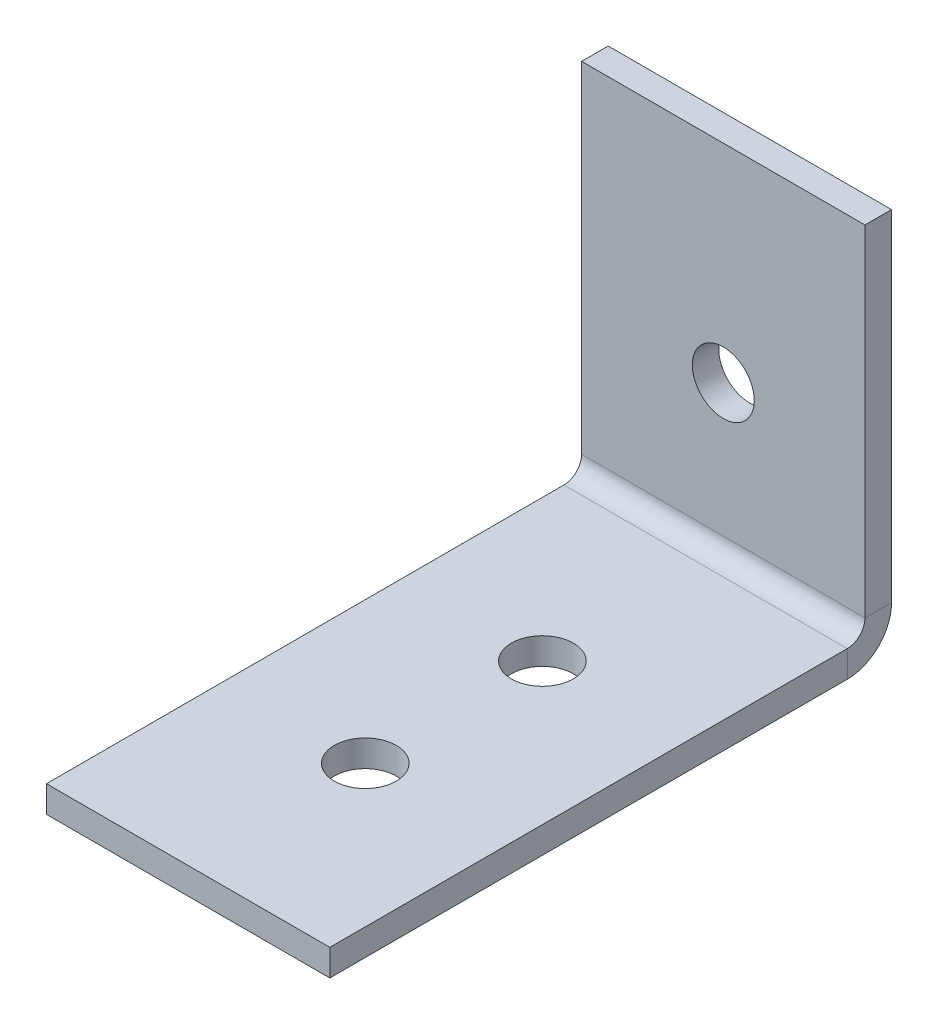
ISO-10303-21;
HEADER;
FILE_DESCRIPTION(('STEP AP214'),'2;1');
FILE_NAME('part.step','',(''),(''),'','','');
FILE_SCHEMA(('AUTOMOTIVE_DESIGN { 1 0 10303 214 1 1 1 1 }'));
ENDSEC;
DATA;
#1=APPLICATION_CONTEXT('core data for automotive mechanical design processes');
#2=APPLICATION_PROTOCOL_DEFINITION('international standard','automotive_design',2000,#1);
#3=PRODUCT_CONTEXT('',#1,'mechanical');
#4=PRODUCT('Part','Part','',(#3));
#5=PRODUCT_RELATED_PRODUCT_CATEGORY('part','',(#4));
#6=PRODUCT_DEFINITION_FORMATION('','',#4);
#7=PRODUCT_DEFINITION_CONTEXT('part definition',#1,'design');
#8=PRODUCT_DEFINITION('design','',#6,#7);
#9=PRODUCT_DEFINITION_SHAPE('','',#8);
#10=(LENGTH_UNIT() NAMED_UNIT(*) SI_UNIT(.MILLI.,.METRE.));
#11=(NAMED_UNIT(*) PLANE_ANGLE_UNIT() SI_UNIT($,.RADIAN.));
#12=(NAMED_UNIT(*) SI_UNIT($,.STERADIAN.) SOLID_ANGLE_UNIT());
#13=UNCERTAINTY_MEASURE_WITH_UNIT(LENGTH_MEASURE(1.E-05),#10,'distance_accuracy_value','');
#14=(GEOMETRIC_REPRESENTATION_CONTEXT(3) GLOBAL_UNCERTAINTY_ASSIGNED_CONTEXT((#13)) GLOBAL_UNIT_ASSIGNED_CONTEXT((#10,
#11,#12)) REPRESENTATION_CONTEXT('',''));
#15=CARTESIAN_POINT('',(0.,0.,0.));
#16=DIRECTION('',(0.,0.,1.));
#17=DIRECTION('',(1.,0.,0.));
#18=AXIS2_PLACEMENT_3D('',#15,#16,#17);
#19=CARTESIAN_POINT('',(16.,-28.2854099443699,-30.2145900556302));
#20=DIRECTION('',(-1.,0.,0.));
#21=DIRECTION('',(0.,-1.,0.));
#22=AXIS2_PLACEMENT_3D('',#19,#20,#21);
#23=PLANE('',#22);
#24=DIRECTION('',(0.,1.,0.));
#25=VECTOR('',#24,1.);
#26=CARTESIAN_POINT('',(16.,-28.2854099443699,-30.2145900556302));
#27=LINE('',#26,#25);
#28=CARTESIAN_POINT('',(16.,2.50000000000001,-30.2145900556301));
#29=VERTEX_POINT('',#28);
#30=CARTESIAN_POINT('',(16.,21.7145900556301,-30.21459005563));
#31=VERTEX_POINT('',#30);
#32=EDGE_CURVE('E99',#29,#31,#27,.T.);
#33=ORIENTED_EDGE('',*,*,#32,.F.);
#34=DIRECTION('',(0.,0.,-1.));
#35=VECTOR('',#34,1.);
#36=CARTESIAN_POINT('',(16.,2.5,-30.2145900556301));
#37=LINE('',#36,#35);
#38=CARTESIAN_POINT('',(16.,2.50000000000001,-31.7145900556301));
#39=VERTEX_POINT('',#38);
#40=EDGE_CURVE('E12',#29,#39,#37,.T.);
#41=ORIENTED_EDGE('',*,*,#40,.T.);
#42=DIRECTION('',(0.,1.,0.));
#43=VECTOR('',#42,1.);
#44=CARTESIAN_POINT('',(16.,-28.2854099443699,-31.7145900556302));
#45=LINE('',#44,#43);
#46=CARTESIAN_POINT('',(16.,21.7145900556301,-31.71459005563));
#47=VERTEX_POINT('',#46);
#48=EDGE_CURVE('E83',#39,#47,#45,.T.);
#49=ORIENTED_EDGE('',*,*,#48,.T.);
#50=DIRECTION('',(0.,0.,-1.));
#51=VECTOR('',#50,1.);
#52=CARTESIAN_POINT('',(16.,21.7145900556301,-30.21459005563));
#53=LINE('',#52,#51);
#54=EDGE_CURVE('E79',#31,#47,#53,.T.);
#55=ORIENTED_EDGE('',*,*,#54,.F.);
#56=EDGE_LOOP('',(#33,#41,#49,#55));
#57=FACE_BOUND('',#56,.T.);
#58=ADVANCED_FACE('F36',(#57),#23,.F.);
#59=CARTESIAN_POINT('',(0.,-28.2854099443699,-30.2145900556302));
#60=DIRECTION('',(1.,0.,0.));
#61=DIRECTION('',(0.,1.,0.));
#62=AXIS2_PLACEMENT_3D('',#59,#60,#61);
#63=PLANE('',#62);
#64=DIRECTION('',(0.,-1.,0.));
#65=VECTOR('',#64,1.);
#66=CARTESIAN_POINT('',(0.,-28.2854099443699,-31.7145900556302));
#67=LINE('',#66,#65);
#68=CARTESIAN_POINT('',(0.,21.7145900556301,-31.71459005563));
#69=VERTEX_POINT('',#68);
#70=CARTESIAN_POINT('',(0.,2.50000000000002,-31.7145900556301));
#71=VERTEX_POINT('',#70);
#72=EDGE_CURVE('E90',#69,#71,#67,.T.);
#73=ORIENTED_EDGE('',*,*,#72,.T.);
#74=DIRECTION('',(0.,0.,1.));
#75=VECTOR('',#74,1.);
#76=CARTESIAN_POINT('',(0.,2.5,-30.2145900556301));
#77=LINE('',#76,#75);
#78=CARTESIAN_POINT('',(0.,2.50000000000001,-30.2145900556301));
#79=VERTEX_POINT('',#78);
#80=EDGE_CURVE('E112',#71,#79,#77,.T.);
#81=ORIENTED_EDGE('',*,*,#80,.T.);
#82=DIRECTION('',(0.,-1.,0.));
#83=VECTOR('',#82,1.);
#84=CARTESIAN_POINT('',(0.,-28.2854099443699,-30.2145900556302));
#85=LINE('',#84,#83);
#86=CARTESIAN_POINT('',(0.,21.7145900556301,-30.21459005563));
#87=VERTEX_POINT('',#86);
#88=EDGE_CURVE('E39',#87,#79,#85,.T.);
#89=ORIENTED_EDGE('',*,*,#88,.F.);
#90=DIRECTION('',(0.,0.,-1.));
#91=VECTOR('',#90,1.);
#92=CARTESIAN_POINT('',(0.,21.7145900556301,-30.21459005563));
#93=LINE('',#92,#91);
#94=EDGE_CURVE('E76',#87,#69,#93,.T.);
#95=ORIENTED_EDGE('',*,*,#94,.T.);
#96=EDGE_LOOP('',(#73,#81,#89,#95));
#97=FACE_BOUND('',#96,.T.);
#98=ADVANCED_FACE('F87',(#97),#63,.F.);
#99=CARTESIAN_POINT('',(0.,21.7145900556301,-30.21459005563));
#100=DIRECTION('',(0.,0.,-1.));
#101=DIRECTION('',(0.,1.,0.));
#102=AXIS2_PLACEMENT_3D('',#99,#100,#101);
#103=PLANE('',#102);
#104=CARTESIAN_POINT('',(8.,10.,-30.2145900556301));
#105=DIRECTION('',(0.,0.,-1.));
#106=DIRECTION('',(0.,1.,0.));
#107=AXIS2_PLACEMENT_3D('',#104,#105,#106);
#108=CIRCLE('',#107,1.75);
#109=CARTESIAN_POINT('',(8.,11.75,-30.2145900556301));
#110=VERTEX_POINT('',#109);
#111=EDGE_CURVE('E168',#110,#110,#108,.T.);
#112=ORIENTED_EDGE('',*,*,#111,.T.);
#113=EDGE_LOOP('',(#112));
#114=FACE_BOUND('',#113,.T.);
#115=ORIENTED_EDGE('',*,*,#88,.T.);
#116=DIRECTION('',(1.,0.,0.));
#117=VECTOR('',#116,1.);
#118=CARTESIAN_POINT('',(0.,2.5,-30.2145900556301));
#119=LINE('',#118,#117);
#120=EDGE_CURVE('E107',#79,#29,#119,.T.);
#121=ORIENTED_EDGE('',*,*,#120,.T.);
#122=ORIENTED_EDGE('',*,*,#32,.T.);
#123=DIRECTION('',(-1.,0.,0.));
#124=VECTOR('',#123,1.);
#125=CARTESIAN_POINT('',(0.,21.7145900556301,-30.21459005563));
#126=LINE('',#125,#124);
#127=EDGE_CURVE('E60',#31,#87,#126,.T.);
#128=ORIENTED_EDGE('',*,*,#127,.T.);
#129=EDGE_LOOP('',(#115,#121,#122,#128));
#130=FACE_BOUND('',#129,.T.);
#131=ADVANCED_FACE('F104',(#114,#130),#103,.F.);
#132=CARTESIAN_POINT('',(0.,21.7145900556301,-31.71459005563));
#133=DIRECTION('',(0.,0.,-1.));
#134=DIRECTION('',(0.,1.,0.));
#135=AXIS2_PLACEMENT_3D('',#132,#133,#134);
#136=PLANE('',#135);
#137=CARTESIAN_POINT('',(8.,10.,-31.7145900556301));
#138=DIRECTION('',(0.,0.,-1.));
#139=DIRECTION('',(0.,1.,0.));
#140=AXIS2_PLACEMENT_3D('',#137,#138,#139);
#141=CIRCLE('',#140,1.75);
#142=CARTESIAN_POINT('',(8.,11.75,-31.7145900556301));
#143=VERTEX_POINT('',#142);
#144=EDGE_CURVE('E175',#143,#143,#141,.T.);
#145=ORIENTED_EDGE('',*,*,#144,.F.);
#146=EDGE_LOOP('',(#145));
#147=FACE_BOUND('',#146,.T.);
#148=DIRECTION('',(1.,0.,0.));
#149=VECTOR('',#148,1.);
#150=CARTESIAN_POINT('',(0.,2.50000000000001,-31.7145900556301));
#151=LINE('',#150,#149);
#152=EDGE_CURVE('E44',#71,#39,#151,.T.);
#153=ORIENTED_EDGE('',*,*,#152,.F.);
#154=ORIENTED_EDGE('',*,*,#72,.F.);
#155=DIRECTION('',(-1.,0.,0.));
#156=VECTOR('',#155,1.);
#157=CARTESIAN_POINT('',(0.,21.7145900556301,-31.71459005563));
#158=LINE('',#157,#156);
#159=EDGE_CURVE('E73',#47,#69,#158,.T.);
#160=ORIENTED_EDGE('',*,*,#159,.F.);
#161=ORIENTED_EDGE('',*,*,#48,.F.);
#162=EDGE_LOOP('',(#153,#154,#160,#161));
#163=FACE_BOUND('',#162,.T.);
#164=ADVANCED_FACE('F92',(#147,#163),#136,.T.);
#165=CARTESIAN_POINT('',(0.,21.7145900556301,-30.21459005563));
#166=DIRECTION('',(0.,-1.,0.));
#167=DIRECTION('',(1.,0.,0.));
#168=AXIS2_PLACEMENT_3D('',#165,#166,#167);
#169=PLANE('',#168);
#170=ORIENTED_EDGE('',*,*,#159,.T.);
#171=ORIENTED_EDGE('',*,*,#94,.F.);
#172=ORIENTED_EDGE('',*,*,#127,.F.);
#173=ORIENTED_EDGE('',*,*,#54,.T.);
#174=EDGE_LOOP('',(#170,#171,#172,#173));
#175=FACE_BOUND('',#174,.T.);
#176=ADVANCED_FACE('F75',(#175),#169,.F.);
#177=CARTESIAN_POINT('',(8.,1.5,-20.));
#178=DIRECTION('',(0.,-1.,0.));
#179=DIRECTION('',(0.,0.,-1.));
#180=AXIS2_PLACEMENT_3D('',#177,#178,#179);
#181=CYLINDRICAL_SURFACE('',#180,1.75);
#182=CARTESIAN_POINT('',(8.,1.5,-20.));
#183=DIRECTION('',(0.,1.,0.));
#184=DIRECTION('',(0.,0.,1.));
#185=AXIS2_PLACEMENT_3D('',#182,#183,#184);
#186=CIRCLE('',#185,1.75);
#187=CARTESIAN_POINT('',(8.,1.5,-18.25));
#188=VERTEX_POINT('',#187);
#189=EDGE_CURVE('E130',#188,#188,#186,.T.);
#190=ORIENTED_EDGE('',*,*,#189,.T.);
#191=EDGE_LOOP('',(#190));
#192=FACE_BOUND('',#191,.T.);
#193=CARTESIAN_POINT('',(8.,0.,-20.));
#194=DIRECTION('',(0.,1.,0.));
#195=DIRECTION('',(0.,0.,1.));
#196=AXIS2_PLACEMENT_3D('',#193,#194,#195);
#197=CIRCLE('',#196,1.75);
#198=CARTESIAN_POINT('',(8.,0.,-18.25));
#199=VERTEX_POINT('',#198);
#200=EDGE_CURVE('E157',#199,#199,#197,.T.);
#201=ORIENTED_EDGE('',*,*,#200,.F.);
#202=EDGE_LOOP('',(#201));
#203=FACE_BOUND('',#202,.T.);
#204=ADVANCED_FACE('F194',(#192,#203),#181,.F.);
#205=CARTESIAN_POINT('',(8.,1.5,-10.));
#206=DIRECTION('',(0.,-1.,0.));
#207=DIRECTION('',(0.,0.,-1.));
#208=AXIS2_PLACEMENT_3D('',#205,#206,#207);
#209=CYLINDRICAL_SURFACE('',#208,1.75);
#210=CARTESIAN_POINT('',(8.,1.5,-10.));
#211=DIRECTION('',(0.,1.,0.));
#212=DIRECTION('',(0.,0.,1.));
#213=AXIS2_PLACEMENT_3D('',#210,#211,#212);
#214=CIRCLE('',#213,1.75);
#215=CARTESIAN_POINT('',(8.,1.5,-8.25));
#216=VERTEX_POINT('',#215);
#217=EDGE_CURVE('E133',#216,#216,#214,.T.);
#218=ORIENTED_EDGE('',*,*,#217,.T.);
#219=EDGE_LOOP('',(#218));
#220=FACE_BOUND('',#219,.T.);
#221=CARTESIAN_POINT('',(8.,0.,-10.));
#222=DIRECTION('',(0.,1.,0.));
#223=DIRECTION('',(0.,0.,1.));
#224=AXIS2_PLACEMENT_3D('',#221,#222,#223);
#225=CIRCLE('',#224,1.75);
#226=CARTESIAN_POINT('',(8.,0.,-8.25));
#227=VERTEX_POINT('',#226);
#228=EDGE_CURVE('E154',#227,#227,#225,.T.);
#229=ORIENTED_EDGE('',*,*,#228,.F.);
#230=EDGE_LOOP('',(#229));
#231=FACE_BOUND('',#230,.T.);
#232=ADVANCED_FACE('F251',(#220,#231),#209,.F.);
#233=CARTESIAN_POINT('',(0.,1.5,0.));
#234=DIRECTION('',(0.,0.,-1.));
#235=DIRECTION('',(-1.,0.,0.));
#236=AXIS2_PLACEMENT_3D('',#233,#234,#235);
#237=PLANE('',#236);
#238=DIRECTION('',(1.,0.,0.));
#239=VECTOR('',#238,1.);
#240=CARTESIAN_POINT('',(0.,0.,0.));
#241=LINE('',#240,#239);
#242=CARTESIAN_POINT('',(0.,0.,0.));
#243=VERTEX_POINT('',#242);
#244=CARTESIAN_POINT('',(16.,0.,0.));
#245=VERTEX_POINT('',#244);
#246=EDGE_CURVE('E136',#243,#245,#241,.T.);
#247=ORIENTED_EDGE('',*,*,#246,.T.);
#248=DIRECTION('',(0.,-1.,0.));
#249=VECTOR('',#248,1.);
#250=CARTESIAN_POINT('',(16.,1.5,0.));
#251=LINE('',#250,#249);
#252=CARTESIAN_POINT('',(16.,1.5,0.));
#253=VERTEX_POINT('',#252);
#254=EDGE_CURVE('E97',#253,#245,#251,.T.);
#255=ORIENTED_EDGE('',*,*,#254,.F.);
#256=DIRECTION('',(1.,0.,0.));
#257=VECTOR('',#256,1.);
#258=CARTESIAN_POINT('',(0.,1.5,0.));
#259=LINE('',#258,#257);
#260=CARTESIAN_POINT('',(0.,1.5,0.));
#261=VERTEX_POINT('',#260);
#262=EDGE_CURVE('E145',#261,#253,#259,.T.);
#263=ORIENTED_EDGE('',*,*,#262,.F.);
#264=DIRECTION('',(0.,-1.,0.));
#265=VECTOR('',#264,1.);
#266=CARTESIAN_POINT('',(0.,1.5,0.));
#267=LINE('',#266,#265);
#268=EDGE_CURVE('E139',#261,#243,#267,.T.);
#269=ORIENTED_EDGE('',*,*,#268,.T.);
#270=EDGE_LOOP('',(#247,#255,#263,#269));
#271=FACE_BOUND('',#270,.T.);
#272=ADVANCED_FACE('F255',(#271),#237,.F.);
#273=CARTESIAN_POINT('',(0.,1.5,-50.));
#274=DIRECTION('',(0.,-1.,0.));
#275=DIRECTION('',(0.,0.,-1.));
#276=AXIS2_PLACEMENT_3D('',#273,#274,#275);
#277=PLANE('',#276);
#278=DIRECTION('',(1.,0.,0.));
#279=VECTOR('',#278,1.);
#280=CARTESIAN_POINT('',(0.,1.5,-29.2145900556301));
#281=LINE('',#280,#279);
#282=CARTESIAN_POINT('',(0.,1.5,-29.2145900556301));
#283=VERTEX_POINT('',#282);
#284=CARTESIAN_POINT('',(16.,1.5,-29.2145900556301));
#285=VERTEX_POINT('',#284);
#286=EDGE_CURVE('E120',#283,#285,#281,.T.);
#287=ORIENTED_EDGE('',*,*,#286,.F.);
#288=DIRECTION('',(0.,0.,1.));
#289=VECTOR('',#288,1.);
#290=CARTESIAN_POINT('',(0.,1.5,0.));
#291=LINE('',#290,#289);
#292=EDGE_CURVE('E142',#283,#261,#291,.T.);
#293=ORIENTED_EDGE('',*,*,#292,.T.);
#294=ORIENTED_EDGE('',*,*,#262,.T.);
#295=DIRECTION('',(0.,0.,-1.));
#296=VECTOR('',#295,1.);
#297=CARTESIAN_POINT('',(16.,1.5,0.));
#298=LINE('',#297,#296);
#299=EDGE_CURVE('E148',#253,#285,#298,.T.);
#300=ORIENTED_EDGE('',*,*,#299,.T.);
#301=EDGE_LOOP('',(#287,#293,#294,#300));
#302=FACE_BOUND('',#301,.T.);
#303=ORIENTED_EDGE('',*,*,#217,.F.);
#304=EDGE_LOOP('',(#303));
#305=FACE_BOUND('',#304,.T.);
#306=ORIENTED_EDGE('',*,*,#189,.F.);
#307=EDGE_LOOP('',(#306));
#308=FACE_BOUND('',#307,.T.);
#309=ADVANCED_FACE('F259',(#302,#305,#308),#277,.F.);
#310=CARTESIAN_POINT('',(0.,1.5,0.));
#311=DIRECTION('',(1.,0.,0.));
#312=DIRECTION('',(0.,0.,-1.));
#313=AXIS2_PLACEMENT_3D('',#310,#311,#312);
#314=PLANE('',#313);
#315=DIRECTION('',(0.,1.,0.));
#316=VECTOR('',#315,1.);
#317=CARTESIAN_POINT('',(0.,1.5,-29.2145900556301));
#318=LINE('',#317,#316);
#319=CARTESIAN_POINT('',(0.,0.,-29.2145900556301));
#320=VERTEX_POINT('',#319);
#321=EDGE_CURVE('E127',#320,#283,#318,.T.);
#322=ORIENTED_EDGE('',*,*,#321,.F.);
#323=DIRECTION('',(0.,0.,1.));
#324=VECTOR('',#323,1.);
#325=CARTESIAN_POINT('',(0.,0.,0.));
#326=LINE('',#325,#324);
#327=EDGE_CURVE('E151',#320,#243,#326,.T.);
#328=ORIENTED_EDGE('',*,*,#327,.T.);
#329=ORIENTED_EDGE('',*,*,#268,.F.);
#330=ORIENTED_EDGE('',*,*,#292,.F.);
#331=EDGE_LOOP('',(#322,#328,#329,#330));
#332=FACE_BOUND('',#331,.T.);
#333=ADVANCED_FACE('F263',(#332),#314,.F.);
#334=CARTESIAN_POINT('',(0.,0.,-50.));
#335=DIRECTION('',(0.,-1.,0.));
#336=DIRECTION('',(0.,0.,-1.));
#337=AXIS2_PLACEMENT_3D('',#334,#335,#336);
#338=PLANE('',#337);
#339=ORIENTED_EDGE('',*,*,#228,.T.);
#340=EDGE_LOOP('',(#339));
#341=FACE_BOUND('',#340,.T.);
#342=ORIENTED_EDGE('',*,*,#200,.T.);
#343=EDGE_LOOP('',(#342));
#344=FACE_BOUND('',#343,.T.);
#345=ORIENTED_EDGE('',*,*,#327,.F.);
#346=DIRECTION('',(1.,0.,0.));
#347=VECTOR('',#346,1.);
#348=CARTESIAN_POINT('',(0.,0.,-29.2145900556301));
#349=LINE('',#348,#347);
#350=CARTESIAN_POINT('',(16.,0.,-29.2145900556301));
#351=VERTEX_POINT('',#350);
#352=EDGE_CURVE('E160',#320,#351,#349,.T.);
#353=ORIENTED_EDGE('',*,*,#352,.T.);
#354=DIRECTION('',(0.,0.,-1.));
#355=VECTOR('',#354,1.);
#356=CARTESIAN_POINT('',(16.,0.,0.));
#357=LINE('',#356,#355);
#358=EDGE_CURVE('E93',#245,#351,#357,.T.);
#359=ORIENTED_EDGE('',*,*,#358,.F.);
#360=ORIENTED_EDGE('',*,*,#246,.F.);
#361=EDGE_LOOP('',(#345,#353,#359,#360));
#362=FACE_BOUND('',#361,.T.);
#363=ADVANCED_FACE('F232',(#341,#344,#362),#338,.T.);
#364=CARTESIAN_POINT('',(16.,1.5,0.));
#365=DIRECTION('',(-1.,0.,0.));
#366=DIRECTION('',(0.,0.,1.));
#367=AXIS2_PLACEMENT_3D('',#364,#365,#366);
#368=PLANE('',#367);
#369=DIRECTION('',(0.,-1.,0.));
#370=VECTOR('',#369,1.);
#371=CARTESIAN_POINT('',(16.,1.5,-29.2145900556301));
#372=LINE('',#371,#370);
#373=EDGE_CURVE('E123',#285,#351,#372,.T.);
#374=ORIENTED_EDGE('',*,*,#373,.F.);
#375=ORIENTED_EDGE('',*,*,#299,.F.);
#376=ORIENTED_EDGE('',*,*,#254,.T.);
#377=ORIENTED_EDGE('',*,*,#358,.T.);
#378=EDGE_LOOP('',(#374,#375,#376,#377));
#379=FACE_BOUND('',#378,.T.);
#380=ADVANCED_FACE('F226',(#379),#368,.F.);
#381=CARTESIAN_POINT('',(0.,2.5,-29.2145900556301));
#382=DIRECTION('',(1.,0.,0.));
#383=DIRECTION('',(0.,0.,-1.));
#384=AXIS2_PLACEMENT_3D('',#381,#382,#383);
#385=PLANE('',#384);
#386=ORIENTED_EDGE('',*,*,#80,.F.);
#387=CARTESIAN_POINT('',(0.,2.5,-29.2145900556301));
#388=DIRECTION('',(-1.,0.,0.));
#389=DIRECTION('',(0.,0.,1.));
#390=AXIS2_PLACEMENT_3D('',#387,#388,#389);
#391=CIRCLE('',#390,2.5);
#392=EDGE_CURVE('E165',#71,#320,#391,.T.);
#393=ORIENTED_EDGE('',*,*,#392,.T.);
#394=ORIENTED_EDGE('',*,*,#321,.T.);
#395=CARTESIAN_POINT('',(0.,2.5,-29.2145900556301));
#396=DIRECTION('',(-1.,0.,0.));
#397=DIRECTION('',(0.,0.,1.));
#398=AXIS2_PLACEMENT_3D('',#395,#396,#397);
#399=CIRCLE('',#398,1.);
#400=EDGE_CURVE('E170',#79,#283,#399,.T.);
#401=ORIENTED_EDGE('',*,*,#400,.F.);
#402=EDGE_LOOP('',(#386,#393,#394,#401));
#403=FACE_BOUND('',#402,.T.);
#404=ADVANCED_FACE('F246',(#403),#385,.F.);
#405=CARTESIAN_POINT('',(16.,2.5,-29.2145900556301));
#406=DIRECTION('',(-1.,0.,0.));
#407=DIRECTION('',(0.,0.,1.));
#408=AXIS2_PLACEMENT_3D('',#405,#406,#407);
#409=PLANE('',#408);
#410=ORIENTED_EDGE('',*,*,#373,.T.);
#411=CARTESIAN_POINT('',(16.,2.5,-29.2145900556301));
#412=DIRECTION('',(-1.,0.,0.));
#413=DIRECTION('',(0.,0.,1.));
#414=AXIS2_PLACEMENT_3D('',#411,#412,#413);
#415=CIRCLE('',#414,2.5);
#416=EDGE_CURVE('E167',#351,#39,#415,.F.);
#417=ORIENTED_EDGE('',*,*,#416,.T.);
#418=ORIENTED_EDGE('',*,*,#40,.F.);
#419=CARTESIAN_POINT('',(16.,2.5,-29.2145900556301));
#420=DIRECTION('',(1.,0.,0.));
#421=DIRECTION('',(0.,0.,-1.));
#422=AXIS2_PLACEMENT_3D('',#419,#420,#421);
#423=CIRCLE('',#422,1.);
#424=EDGE_CURVE('E124',#285,#29,#423,.T.);
#425=ORIENTED_EDGE('',*,*,#424,.F.);
#426=EDGE_LOOP('',(#410,#417,#418,#425));
#427=FACE_BOUND('',#426,.T.);
#428=ADVANCED_FACE('F234',(#427),#409,.F.);
#429=CARTESIAN_POINT('',(24.146748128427,2.5,-29.2145900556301));
#430=DIRECTION('',(-1.,0.,0.));
#431=DIRECTION('',(0.,0.,1.));
#432=AXIS2_PLACEMENT_3D('',#429,#430,#431);
#433=CYLINDRICAL_SURFACE('',#432,1.);
#434=ORIENTED_EDGE('',*,*,#424,.T.);
#435=ORIENTED_EDGE('',*,*,#120,.F.);
#436=ORIENTED_EDGE('',*,*,#400,.T.);
#437=ORIENTED_EDGE('',*,*,#286,.T.);
#438=EDGE_LOOP('',(#434,#435,#436,#437));
#439=FACE_BOUND('',#438,.T.);
#440=ADVANCED_FACE('F236',(#439),#433,.F.);
#441=CARTESIAN_POINT('',(24.146748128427,2.5,-29.2145900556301));
#442=DIRECTION('',(-1.,0.,0.));
#443=DIRECTION('',(0.,0.,1.));
#444=AXIS2_PLACEMENT_3D('',#441,#442,#443);
#445=CYLINDRICAL_SURFACE('',#444,2.5);
#446=ORIENTED_EDGE('',*,*,#416,.F.);
#447=ORIENTED_EDGE('',*,*,#352,.F.);
#448=ORIENTED_EDGE('',*,*,#392,.F.);
#449=ORIENTED_EDGE('',*,*,#152,.T.);
#450=EDGE_LOOP('',(#446,#447,#448,#449));
#451=FACE_BOUND('',#450,.T.);
#452=ADVANCED_FACE('F185',(#451),#445,.T.);
#453=CARTESIAN_POINT('',(8.,10.,-30.2145900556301));
#454=DIRECTION('',(0.,0.,-1.));
#455=DIRECTION('',(0.,1.,0.));
#456=AXIS2_PLACEMENT_3D('',#453,#454,#455);
#457=CYLINDRICAL_SURFACE('',#456,1.75);
#458=ORIENTED_EDGE('',*,*,#111,.F.);
#459=EDGE_LOOP('',(#458));
#460=FACE_BOUND('',#459,.T.);
#461=ORIENTED_EDGE('',*,*,#144,.T.);
#462=EDGE_LOOP('',(#461));
#463=FACE_BOUND('',#462,.T.);
#464=ADVANCED_FACE('F182',(#460,#463),#457,.F.);
#465=CLOSED_SHELL('',(#58,#98,#131,#164,#176,#204,#232,#272,#309,#333,#363,#380,#404,#428,#440,
#452,#464));
#466=MANIFOLD_SOLID_BREP('B2',#465);
#467=ADVANCED_BREP_SHAPE_REPRESENTATION('',(#18,#466),#14);
#468=SHAPE_DEFINITION_REPRESENTATION(#9,#467);
ENDSEC;
END-ISO-10303-21;
